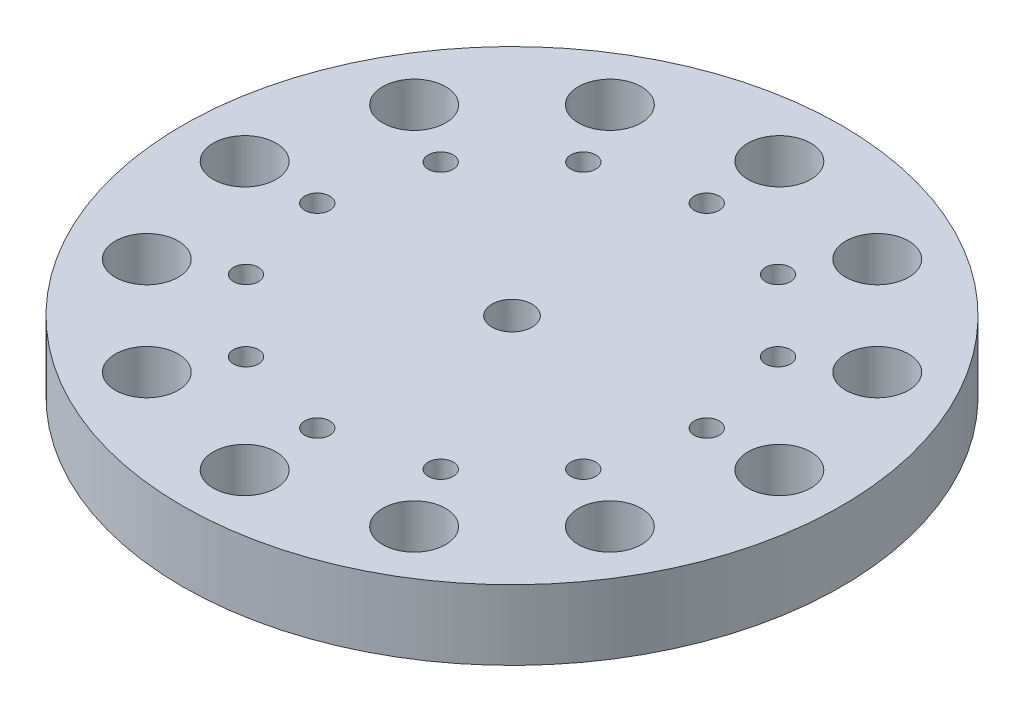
from build123d import *

# Parameters (mm, degrees)
SKETCH2_W                                   = 104.775
SKETCH2_H                                   = 22.225
SKETCH2_3_W                                 = 104.775
SKETCH2_3_H                                 = 38.1
SKETCH18_R                                  = 87
CUT_EXTRUDE2_DEPTH                          = 19.05
CBORE_FOR_M12_SHCS1_AT_2_COUNT              = 2
CBORE_FOR_M12_SHCS1_AT_2_PITCH              = 43.999235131
CBORE_FOR_M12_SHCS1_AT_3_COUNT              = 2
CBORE_FOR_M12_SHCS1_AT_3_PITCH              = 84.9999951
CBORE_FOR_M12_SHCS1_AT_4_COUNT              = 2
CBORE_FOR_M12_SHCS1_AT_4_PITCH              = 120.208145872
CBORE_FOR_M12_SHCS1_AT_5_COUNT              = 2
CBORE_FOR_M12_SHCS1_AT_5_PITCH              = 147.224310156
CBORE_FOR_M12_SHCS1_AT_6_COUNT              = 2
CBORE_FOR_M12_SHCS1_AT_6_PITCH              = 164.207381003
CBORE_FOR_M12_SHCS1_AT_7_COUNT              = 2
CBORE_FOR_M12_SHCS1_AT_7_PITCH              = 169.9999902
CBORE_FOR_M12_SHCS1_AT_8_COUNT              = 2
CBORE_FOR_M12_SHCS1_AT_8_PITCH              = 164.207381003
CBORE_FOR_M12_SHCS1_AT_9_COUNT              = 2
CBORE_FOR_M12_SHCS1_AT_9_PITCH              = 147.224310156
CBORE_FOR_M12_SHCS1_AT_10_COUNT             = 2
CBORE_FOR_M12_SHCS1_AT_10_PITCH             = 120.208145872
CBORE_FOR_M12_SHCS1_AT_11_COUNT             = 2
CBORE_FOR_M12_SHCS1_AT_11_PITCH             = 84.9999951
CBORE_FOR_M12_SHCS1_AT_12_COUNT             = 2
CBORE_FOR_M12_SHCS1_AT_12_PITCH             = 43.999235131
CBORE_FOR_M6_SHCS1_AT_2_COUNT               = 2
CBORE_FOR_M6_SHCS1_AT_2_PITCH               = 50.469713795
CBORE_FOR_M6_SHCS1_AT_3_COUNT               = 2
CBORE_FOR_M6_SHCS1_AT_3_PITCH               = 97.5
CBORE_FOR_M6_SHCS1_AT_4_COUNT               = 2
CBORE_FOR_M6_SHCS1_AT_4_PITCH               = 137.885822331
CBORE_FOR_M6_SHCS1_AT_5_COUNT               = 2
CBORE_FOR_M6_SHCS1_AT_5_PITCH               = 168.874953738
CBORE_FOR_M6_SHCS1_AT_6_COUNT               = 2
CBORE_FOR_M6_SHCS1_AT_6_PITCH               = 188.355536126
CBORE_FOR_M6_SHCS1_AT_7_COUNT               = 2
CBORE_FOR_M6_SHCS1_AT_7_PITCH               = 195
CBORE_FOR_M6_SHCS1_AT_8_COUNT               = 2
CBORE_FOR_M6_SHCS1_AT_8_PITCH               = 188.355536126
CBORE_FOR_M6_SHCS1_AT_9_COUNT               = 2
CBORE_FOR_M6_SHCS1_AT_9_PITCH               = 168.874953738
CBORE_FOR_M6_SHCS1_AT_10_COUNT              = 2
CBORE_FOR_M6_SHCS1_AT_10_PITCH              = 137.885822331
CBORE_FOR_M6_SHCS1_AT_11_COUNT              = 2
CBORE_FOR_M6_SHCS1_AT_11_PITCH              = 97.5
CBORE_FOR_M6_SHCS1_AT_12_COUNT              = 2
CBORE_FOR_M6_SHCS1_AT_12_PITCH              = 50.469713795
CBORE_FOR_3_8_HEX_WASHER_SCREW1_AT_2_COUNT  = 2
CBORE_FOR_3_8_HEX_WASHER_SCREW1_AT_2_PITCH  = 32.04826826
CBORE_FOR_3_8_HEX_WASHER_SCREW1_AT_3_COUNT  = 2
CBORE_FOR_3_8_HEX_WASHER_SCREW1_AT_3_PITCH  = 61.9125
CBORE_FOR_3_8_HEX_WASHER_SCREW1_AT_4_COUNT  = 2
CBORE_FOR_3_8_HEX_WASHER_SCREW1_AT_4_PITCH  = 87.55749718
CBORE_FOR_3_8_HEX_WASHER_SCREW1_AT_5_COUNT  = 2
CBORE_FOR_3_8_HEX_WASHER_SCREW1_AT_5_PITCH  = 107.235595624
CBORE_FOR_3_8_HEX_WASHER_SCREW1_AT_6_COUNT  = 2
CBORE_FOR_3_8_HEX_WASHER_SCREW1_AT_6_PITCH  = 119.60576544
CBORE_FOR_3_8_HEX_WASHER_SCREW1_AT_7_COUNT  = 2
CBORE_FOR_3_8_HEX_WASHER_SCREW1_AT_7_PITCH  = 123.825
CBORE_FOR_3_8_HEX_WASHER_SCREW1_AT_8_COUNT  = 2
CBORE_FOR_3_8_HEX_WASHER_SCREW1_AT_8_PITCH  = 119.60576544
CBORE_FOR_3_8_HEX_WASHER_SCREW1_AT_9_COUNT  = 2
CBORE_FOR_3_8_HEX_WASHER_SCREW1_AT_9_PITCH  = 107.235595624
CBORE_FOR_3_8_HEX_WASHER_SCREW1_AT_10_COUNT = 2
CBORE_FOR_3_8_HEX_WASHER_SCREW1_AT_10_PITCH = 87.55749718
CBORE_FOR_3_8_HEX_WASHER_SCREW1_AT_11_COUNT = 2
CBORE_FOR_3_8_HEX_WASHER_SCREW1_AT_11_PITCH = 61.9125
CBORE_FOR_3_8_HEX_WASHER_SCREW1_AT_12_COUNT = 2
CBORE_FOR_3_8_HEX_WASHER_SCREW1_AT_12_PITCH = 32.04826826
SKETCH14_W                                  = 3.96875
SKETCH14_H                                  = 22.225
F_3_8_16_TAPPED_HOLE1_AT_2_COUNT            = 2
F_3_8_16_TAPPED_HOLE1_AT_2_PITCH            = 32.04826826
F_3_8_16_TAPPED_HOLE1_AT_3_COUNT            = 2
F_3_8_16_TAPPED_HOLE1_AT_3_PITCH            = 61.9125
F_3_8_16_TAPPED_HOLE1_AT_4_COUNT            = 2
F_3_8_16_TAPPED_HOLE1_AT_4_PITCH            = 87.55749718
F_3_8_16_TAPPED_HOLE1_AT_5_COUNT            = 2
F_3_8_16_TAPPED_HOLE1_AT_5_PITCH            = 107.235595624
F_3_8_16_TAPPED_HOLE1_AT_6_COUNT            = 2
F_3_8_16_TAPPED_HOLE1_AT_6_PITCH            = 119.60576544
F_3_8_16_TAPPED_HOLE1_AT_7_COUNT            = 2
F_3_8_16_TAPPED_HOLE1_AT_7_PITCH            = 123.825
F_3_8_16_TAPPED_HOLE1_AT_8_COUNT            = 2
F_3_8_16_TAPPED_HOLE1_AT_8_PITCH            = 119.60576544
F_3_8_16_TAPPED_HOLE1_AT_9_COUNT            = 2
F_3_8_16_TAPPED_HOLE1_AT_9_PITCH            = 107.235595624
F_3_8_16_TAPPED_HOLE1_AT_10_COUNT           = 2
F_3_8_16_TAPPED_HOLE1_AT_10_PITCH           = 87.55749718
F_3_8_16_TAPPED_HOLE1_AT_11_COUNT           = 2
F_3_8_16_TAPPED_HOLE1_AT_11_PITCH           = 61.9125
F_3_8_16_TAPPED_HOLE1_AT_12_COUNT           = 2
F_3_8_16_TAPPED_HOLE1_AT_12_PITCH           = 32.04826826
SKETCH15_R                                  = 92.974600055
SKETCH15_R_2                                = 87
BOSS_EXTRUDE1_DEPTH                         = 3.175
CHAMFER1_SIZE                               = 0.508
SKETCH16_R                                  = 76.4921
SKETCH16_R_2                                = 3.96875
BOSS_EXTRUDE2_DEPTH                         = 9.525
CHAMFER2_SIZE                               = 0.508
CUT_EXTRUDE1_DEPTH                          = 166.191561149
CUT_EXTRUDE1_DEPTH_BACK                     = 166.191561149
SKETCH17_R                                  = 6.3627


with BuildPart() as part:
    # Sketch2 → Revolve2 (revolve)
    with BuildSketch(Plane(origin=(0, 0, 0), x_dir=(0, 0, -1), z_dir=(1, 0, 0))):
        with Locations((-52.3875, 11.1125)):
            Rectangle(SKETCH2_W, SKETCH2_H)
    revolve(axis=Axis((0, 0, 0), (0, -1, 0)))

    # Sketch4 → CBORE for M12 SHCS1 (revolve, cut)
    with BuildSketch(Plane(origin=(0, 22.225, -84.9999951), x_dir=(0, 0, 1), z_dir=(1, 0, 0))):
        Polygon((0, 0), (0, 22.225), (6.5, 22.225), (6.5, 14.999994), (10, 14.999994), (10, 0), align=None)
    cbore_for_m12_shcs1 = revolve(axis=Axis((0, 28.575, -84.9999951), (0, -1, 0)), mode=Mode.SUBTRACT)

    # CBORE for M12 SHCS1 at 2: CBORE for M12 SHCS1 ×2
    with Locations(*[Vector(0.9659258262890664, 0, 0.2588190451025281) * (i * CBORE_FOR_M12_SHCS1_AT_2_PITCH) for i in range(1, CBORE_FOR_M12_SHCS1_AT_2_COUNT)]):
        add(cbore_for_m12_shcs1, mode=Mode.SUBTRACT)

    # CBORE for M12 SHCS1 at 3: CBORE for M12 SHCS1 ×2
    with Locations(*[Vector(0.8660254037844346, 0, 0.5000000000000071) * (i * CBORE_FOR_M12_SHCS1_AT_3_PITCH) for i in range(1, CBORE_FOR_M12_SHCS1_AT_3_COUNT)]):
        add(cbore_for_m12_shcs1, mode=Mode.SUBTRACT)

    # CBORE for M12 SHCS1 at 4: CBORE for M12 SHCS1 ×2
    with Locations(*[Vector(0.7071067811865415, 0, 0.7071067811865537) * (i * CBORE_FOR_M12_SHCS1_AT_4_PITCH) for i in range(1, CBORE_FOR_M12_SHCS1_AT_4_COUNT)]):
        add(cbore_for_m12_shcs1, mode=Mode.SUBTRACT)

    # CBORE for M12 SHCS1 at 5: CBORE for M12 SHCS1 ×2
    with Locations(*[Vector(0.499999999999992, 0, 0.8660254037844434) * (i * CBORE_FOR_M12_SHCS1_AT_5_PITCH) for i in range(1, CBORE_FOR_M12_SHCS1_AT_5_COUNT)]):
        add(cbore_for_m12_shcs1, mode=Mode.SUBTRACT)

    # CBORE for M12 SHCS1 at 6: CBORE for M12 SHCS1 ×2
    with Locations(*[Vector(0.25881904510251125, 0, 0.9659258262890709) * (i * CBORE_FOR_M12_SHCS1_AT_6_PITCH) for i in range(1, CBORE_FOR_M12_SHCS1_AT_6_COUNT)]):
        add(cbore_for_m12_shcs1, mode=Mode.SUBTRACT)

    # CBORE for M12 SHCS1 at 7: CBORE for M12 SHCS1 ×2
    with Locations(*[(0, 0, i * CBORE_FOR_M12_SHCS1_AT_7_PITCH) for i in range(1, CBORE_FOR_M12_SHCS1_AT_7_COUNT)]):
        add(cbore_for_m12_shcs1, mode=Mode.SUBTRACT)

    # CBORE for M12 SHCS1 at 8: CBORE for M12 SHCS1 ×2
    with Locations(*[Vector(-0.2588190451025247, 0, 0.9659258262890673) * (i * CBORE_FOR_M12_SHCS1_AT_8_PITCH) for i in range(1, CBORE_FOR_M12_SHCS1_AT_8_COUNT)]):
        add(cbore_for_m12_shcs1, mode=Mode.SUBTRACT)

    # CBORE for M12 SHCS1 at 9: CBORE for M12 SHCS1 ×2
    with Locations(*[Vector(-0.5000000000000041, 0, 0.8660254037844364) * (i * CBORE_FOR_M12_SHCS1_AT_9_PITCH) for i in range(1, CBORE_FOR_M12_SHCS1_AT_9_COUNT)]):
        add(cbore_for_m12_shcs1, mode=Mode.SUBTRACT)

    # CBORE for M12 SHCS1 at 10: CBORE for M12 SHCS1 ×2
    with Locations(*[Vector(-0.7071067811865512, 0, 0.7071067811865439) * (i * CBORE_FOR_M12_SHCS1_AT_10_PITCH) for i in range(1, CBORE_FOR_M12_SHCS1_AT_10_COUNT)]):
        add(cbore_for_m12_shcs1, mode=Mode.SUBTRACT)

    # CBORE for M12 SHCS1 at 11: CBORE for M12 SHCS1 ×2
    with Locations(*[Vector(-0.8660254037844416, 0, 0.4999999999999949) * (i * CBORE_FOR_M12_SHCS1_AT_11_PITCH) for i in range(1, CBORE_FOR_M12_SHCS1_AT_11_COUNT)]):
        add(cbore_for_m12_shcs1, mode=Mode.SUBTRACT)

    # CBORE for M12 SHCS1 at 12: CBORE for M12 SHCS1 ×2
    with Locations(*[Vector(-0.96592582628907, 0, 0.2588190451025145) * (i * CBORE_FOR_M12_SHCS1_AT_12_PITCH) for i in range(1, CBORE_FOR_M12_SHCS1_AT_12_COUNT)]):
        add(cbore_for_m12_shcs1, mode=Mode.SUBTRACT)

    # Sketch14 → 3_8-16 Tapped Hole1 (revolve, cut)
    with BuildSketch(Plane(origin=(-53.617797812, 22.225, -30.95625), x_dir=(0, 0, 1), z_dir=(1, 0, 0))):
        with Locations((1.984375, 11.1125)):
            Rectangle(SKETCH14_W, SKETCH14_H)
    f_3_8_16_tapped_hole1 = revolve(axis=Axis((-53.617797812, 28.575, -30.95625), (0, -1, 0)), mode=Mode.SUBTRACT)

    # 3_8-16 Tapped Hole1 at 2: 3_8-16 Tapped Hole1 ×2
    with Locations(*[Vector(-0.25881904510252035, 0, 0.9659258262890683) * (i * F_3_8_16_TAPPED_HOLE1_AT_2_PITCH) for i in range(1, F_3_8_16_TAPPED_HOLE1_AT_2_COUNT)]):
        add(f_3_8_16_tapped_hole1, mode=Mode.SUBTRACT)

    # 3_8-16 Tapped Hole1 at 3: 3_8-16 Tapped Hole1 ×2
    with Locations(*[(0, 0, i * F_3_8_16_TAPPED_HOLE1_AT_3_PITCH) for i in range(1, F_3_8_16_TAPPED_HOLE1_AT_3_COUNT)]):
        add(f_3_8_16_tapped_hole1, mode=Mode.SUBTRACT)

    # 3_8-16 Tapped Hole1 at 4: 3_8-16 Tapped Hole1 ×2
    with Locations(*[Vector(0.2588190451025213, 0, 0.9659258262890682) * (i * F_3_8_16_TAPPED_HOLE1_AT_4_PITCH) for i in range(1, F_3_8_16_TAPPED_HOLE1_AT_4_COUNT)]):
        add(f_3_8_16_tapped_hole1, mode=Mode.SUBTRACT)

    # 3_8-16 Tapped Hole1 at 5: 3_8-16 Tapped Hole1 ×2
    with Locations(*[Vector(0.5000000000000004, 0, 0.8660254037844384) * (i * F_3_8_16_TAPPED_HOLE1_AT_5_PITCH) for i in range(1, F_3_8_16_TAPPED_HOLE1_AT_5_COUNT)]):
        add(f_3_8_16_tapped_hole1, mode=Mode.SUBTRACT)

    # 3_8-16 Tapped Hole1 at 6: 3_8-16 Tapped Hole1 ×2
    with Locations(*[Vector(0.707106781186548, 0, 0.707106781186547) * (i * F_3_8_16_TAPPED_HOLE1_AT_6_PITCH) for i in range(1, F_3_8_16_TAPPED_HOLE1_AT_6_COUNT)]):
        add(f_3_8_16_tapped_hole1, mode=Mode.SUBTRACT)

    # 3_8-16 Tapped Hole1 at 7: 3_8-16 Tapped Hole1 ×2
    with Locations(*[Vector(0.8660254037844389, 0, 0.49999999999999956) * (i * F_3_8_16_TAPPED_HOLE1_AT_7_PITCH) for i in range(1, F_3_8_16_TAPPED_HOLE1_AT_7_COUNT)]):
        add(f_3_8_16_tapped_hole1, mode=Mode.SUBTRACT)

    # 3_8-16 Tapped Hole1 at 8: 3_8-16 Tapped Hole1 ×2
    with Locations(*[Vector(0.9659258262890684, 0, 0.2588190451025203) * (i * F_3_8_16_TAPPED_HOLE1_AT_8_PITCH) for i in range(1, F_3_8_16_TAPPED_HOLE1_AT_8_COUNT)]):
        add(f_3_8_16_tapped_hole1, mode=Mode.SUBTRACT)

    # 3_8-16 Tapped Hole1 at 9: 3_8-16 Tapped Hole1 ×2
    with Locations(*[(i * F_3_8_16_TAPPED_HOLE1_AT_9_PITCH, 0, 0) for i in range(1, F_3_8_16_TAPPED_HOLE1_AT_9_COUNT)]):
        add(f_3_8_16_tapped_hole1, mode=Mode.SUBTRACT)

    # 3_8-16 Tapped Hole1 at 10: 3_8-16 Tapped Hole1 ×2
    with Locations(*[Vector(0.9659258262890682, 0, -0.2588190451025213) * (i * F_3_8_16_TAPPED_HOLE1_AT_10_PITCH) for i in range(1, F_3_8_16_TAPPED_HOLE1_AT_10_COUNT)]):
        add(f_3_8_16_tapped_hole1, mode=Mode.SUBTRACT)

    # 3_8-16 Tapped Hole1 at 11: 3_8-16 Tapped Hole1 ×2
    with Locations(*[Vector(0.8660254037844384, 0, -0.5000000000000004) * (i * F_3_8_16_TAPPED_HOLE1_AT_11_PITCH) for i in range(1, F_3_8_16_TAPPED_HOLE1_AT_11_COUNT)]):
        add(f_3_8_16_tapped_hole1, mode=Mode.SUBTRACT)

    # 3_8-16 Tapped Hole1 at 12: 3_8-16 Tapped Hole1 ×2
    with Locations(*[Vector(0.707106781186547, 0, -0.7071067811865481) * (i * F_3_8_16_TAPPED_HOLE1_AT_12_PITCH) for i in range(1, F_3_8_16_TAPPED_HOLE1_AT_12_COUNT)]):
        add(f_3_8_16_tapped_hole1, mode=Mode.SUBTRACT)

    # Sketch16 → Boss-Extrude2 (add)
    with BuildSketch(Plane.XZ):
        with Locations(Location((0, 0, 0), (0, 0, 90))):
            Circle(SKETCH16_R)
        with Locations(Location((0, -61.9125, 0), (0, 0, 90))):
            Circle(SKETCH16_R_2, mode=Mode.SUBTRACT)
        with Locations(Location((30.95625, -53.617797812, 0), (0, 0, 90))):
            Circle(SKETCH16_R_2, mode=Mode.SUBTRACT)
        with Locations(Location((53.617797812, -30.95625, 0), (0, 0, 90))):
            Circle(SKETCH16_R_2, mode=Mode.SUBTRACT)
        with Locations(Location((61.9125, 0, 0), (0, 0, 90))):
            Circle(SKETCH16_R_2, mode=Mode.SUBTRACT)
        with Locations(Location((53.617797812, 30.95625, 0), (0, 0, 90))):
            Circle(SKETCH16_R_2, mode=Mode.SUBTRACT)
        with Locations(Location((30.95625, 53.617797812, 0), (0, 0, 90))):
            Circle(SKETCH16_R_2, mode=Mode.SUBTRACT)
        with Locations(Location((0, 61.9125, 0), (0, 0, 90))):
            Circle(SKETCH16_R_2, mode=Mode.SUBTRACT)
        with Locations(Location((-30.95625, 53.617797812, 0), (0, 0, 90))):
            Circle(SKETCH16_R_2, mode=Mode.SUBTRACT)
        with Locations(Location((-53.617797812, 30.95625, 0), (0, 0, 90))):
            Circle(SKETCH16_R_2, mode=Mode.SUBTRACT)
        with Locations(Location((-61.9125, 0, 0), (0, 0, 90))):
            Circle(SKETCH16_R_2, mode=Mode.SUBTRACT)
        with Locations(Location((-53.617797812, -30.95625, 0), (0, 0, 90))):
            Circle(SKETCH16_R_2, mode=Mode.SUBTRACT)
        with Locations(Location((-30.95625, -53.617797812, 0), (0, 0, 90))):
            Circle(SKETCH16_R_2, mode=Mode.SUBTRACT)
    extrude(amount=BOSS_EXTRUDE2_DEPTH)

    # Chamfer2
    chamfer2_edges = [part.edges().sort_by_distance(p)[0] for p in [
        (0, -9.525, -76.4921),
    ]]
    chamfer(chamfer2_edges, length=CHAMFER2_SIZE)


with BuildPart() as body_2:
    # Sketch2_3 → Revolve3 (revolve)
    with BuildSketch(Plane(origin=(0, 0, 0), x_dir=(0, 0, -1), z_dir=(1, 0, 0))):
        with Locations((-52.3875, 41.275)):
            Rectangle(SKETCH2_3_W, SKETCH2_3_H)
    revolve(axis=Axis((0, 0, 0), (0, -1, 0)))

    # Sketch18 → Cut-Extrude2 (cut)
    with BuildSketch(Plane(origin=(0, 60.325, 0), x_dir=(1, 0, 0), z_dir=(0, 1, 0))):
        with Locations(Location((0, 0, 0), (0, 0, 270))):
            Circle(SKETCH18_R)
    extrude(amount=-CUT_EXTRUDE2_DEPTH, mode=Mode.SUBTRACT)

    # Sketch7 → CBORE for M6 SHCS1 (revolve, cut)
    with BuildSketch(Plane(origin=(0, 22.225, -97.5), x_dir=(0, 0, -1), z_dir=(1, 0, 0))):
        Polygon((0, 0), (0, 38.1), (3.2, 38.1), (3.2, 7.999996), (5.5, 7.999996), (5.5, 0), align=None)
    cbore_for_m6_shcs1 = revolve(axis=Axis((0, 15.875, -97.5), (0, 1, 0)), mode=Mode.SUBTRACT)

    # CBORE for M6 SHCS1 at 2: CBORE for M6 SHCS1 ×2
    with Locations(*[Vector(-0.9659258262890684, 0, 0.2588190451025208) * (i * CBORE_FOR_M6_SHCS1_AT_2_PITCH) for i in range(1, CBORE_FOR_M6_SHCS1_AT_2_COUNT)]):
        add(cbore_for_m6_shcs1, mode=Mode.SUBTRACT)

    # CBORE for M6 SHCS1 at 3: CBORE for M6 SHCS1 ×2
    with Locations(*[Vector(-0.8660254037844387, 0, 0.5000000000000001) * (i * CBORE_FOR_M6_SHCS1_AT_3_PITCH) for i in range(1, CBORE_FOR_M6_SHCS1_AT_3_COUNT)]):
        add(cbore_for_m6_shcs1, mode=Mode.SUBTRACT)

    # CBORE for M6 SHCS1 at 4: CBORE for M6 SHCS1 ×2
    with Locations(*[Vector(-0.7071067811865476, 0, 0.7071067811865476) * (i * CBORE_FOR_M6_SHCS1_AT_4_PITCH) for i in range(1, CBORE_FOR_M6_SHCS1_AT_4_COUNT)]):
        add(cbore_for_m6_shcs1, mode=Mode.SUBTRACT)

    # CBORE for M6 SHCS1 at 5: CBORE for M6 SHCS1 ×2
    with Locations(*[Vector(-0.5000000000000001, 0, 0.8660254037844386) * (i * CBORE_FOR_M6_SHCS1_AT_5_PITCH) for i in range(1, CBORE_FOR_M6_SHCS1_AT_5_COUNT)]):
        add(cbore_for_m6_shcs1, mode=Mode.SUBTRACT)

    # CBORE for M6 SHCS1 at 6: CBORE for M6 SHCS1 ×2
    with Locations(*[Vector(-0.25881904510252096, 0, 0.9659258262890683) * (i * CBORE_FOR_M6_SHCS1_AT_6_PITCH) for i in range(1, CBORE_FOR_M6_SHCS1_AT_6_COUNT)]):
        add(cbore_for_m6_shcs1, mode=Mode.SUBTRACT)

    # CBORE for M6 SHCS1 at 7: CBORE for M6 SHCS1 ×2
    with Locations(*[(0, 0, i * CBORE_FOR_M6_SHCS1_AT_7_PITCH) for i in range(1, CBORE_FOR_M6_SHCS1_AT_7_COUNT)]):
        add(cbore_for_m6_shcs1, mode=Mode.SUBTRACT)

    # CBORE for M6 SHCS1 at 8: CBORE for M6 SHCS1 ×2
    with Locations(*[Vector(0.2588190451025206, 0, 0.9659258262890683) * (i * CBORE_FOR_M6_SHCS1_AT_8_PITCH) for i in range(1, CBORE_FOR_M6_SHCS1_AT_8_COUNT)]):
        add(cbore_for_m6_shcs1, mode=Mode.SUBTRACT)

    # CBORE for M6 SHCS1 at 9: CBORE for M6 SHCS1 ×2
    with Locations(*[Vector(0.49999999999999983, 0, 0.8660254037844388) * (i * CBORE_FOR_M6_SHCS1_AT_9_PITCH) for i in range(1, CBORE_FOR_M6_SHCS1_AT_9_COUNT)]):
        add(cbore_for_m6_shcs1, mode=Mode.SUBTRACT)

    # CBORE for M6 SHCS1 at 10: CBORE for M6 SHCS1 ×2
    with Locations(*[Vector(0.7071067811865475, 0, 0.7071067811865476) * (i * CBORE_FOR_M6_SHCS1_AT_10_PITCH) for i in range(1, CBORE_FOR_M6_SHCS1_AT_10_COUNT)]):
        add(cbore_for_m6_shcs1, mode=Mode.SUBTRACT)

    # CBORE for M6 SHCS1 at 11: CBORE for M6 SHCS1 ×2
    with Locations(*[Vector(0.8660254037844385, 0, 0.5000000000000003) * (i * CBORE_FOR_M6_SHCS1_AT_11_PITCH) for i in range(1, CBORE_FOR_M6_SHCS1_AT_11_COUNT)]):
        add(cbore_for_m6_shcs1, mode=Mode.SUBTRACT)

    # CBORE for M6 SHCS1 at 12: CBORE for M6 SHCS1 ×2
    with Locations(*[Vector(0.9659258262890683, 0, 0.2588190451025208) * (i * CBORE_FOR_M6_SHCS1_AT_12_PITCH) for i in range(1, CBORE_FOR_M6_SHCS1_AT_12_COUNT)]):
        add(cbore_for_m6_shcs1, mode=Mode.SUBTRACT)

    # Sketch12 → CBORE for 3_8 Hex Washer Screw1 (revolve, cut)
    with BuildSketch(Plane(origin=(0, 41.275, -61.9125), x_dir=(0, 0, 1), z_dir=(1, 0, 0))):
        Polygon((0, 0), (0, 41.275), (4.9022, 41.275), (4.9022, 10.6934), (11.1125, 10.6934), (11.1125, 0), align=None)
    cbore_for_3_8_hex_washer_screw1 = revolve(axis=Axis((0, 47.625, -61.9125), (0, -1, 0)), mode=Mode.SUBTRACT)

    # CBORE for 3_8 Hex Washer Screw1 at 2: CBORE for 3_8 Hex Washer Screw1 ×2
    with Locations(*[Vector(0.9659258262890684, 0, 0.2588190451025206) * (i * CBORE_FOR_3_8_HEX_WASHER_SCREW1_AT_2_PITCH) for i in range(1, CBORE_FOR_3_8_HEX_WASHER_SCREW1_AT_2_COUNT)]):
        add(cbore_for_3_8_hex_washer_screw1, mode=Mode.SUBTRACT)

    # CBORE for 3_8 Hex Washer Screw1 at 3: CBORE for 3_8 Hex Washer Screw1 ×2
    with Locations(*[Vector(0.8660254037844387, 0, 0.49999999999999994) * (i * CBORE_FOR_3_8_HEX_WASHER_SCREW1_AT_3_PITCH) for i in range(1, CBORE_FOR_3_8_HEX_WASHER_SCREW1_AT_3_COUNT)]):
        add(cbore_for_3_8_hex_washer_screw1, mode=Mode.SUBTRACT)

    # CBORE for 3_8 Hex Washer Screw1 at 4: CBORE for 3_8 Hex Washer Screw1 ×2
    with Locations(*[Vector(0.7071067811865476, 0, 0.7071067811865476) * (i * CBORE_FOR_3_8_HEX_WASHER_SCREW1_AT_4_PITCH) for i in range(1, CBORE_FOR_3_8_HEX_WASHER_SCREW1_AT_4_COUNT)]):
        add(cbore_for_3_8_hex_washer_screw1, mode=Mode.SUBTRACT)

    # CBORE for 3_8 Hex Washer Screw1 at 5: CBORE for 3_8 Hex Washer Screw1 ×2
    with Locations(*[Vector(0.5000000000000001, 0, 0.8660254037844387) * (i * CBORE_FOR_3_8_HEX_WASHER_SCREW1_AT_5_PITCH) for i in range(1, CBORE_FOR_3_8_HEX_WASHER_SCREW1_AT_5_COUNT)]):
        add(cbore_for_3_8_hex_washer_screw1, mode=Mode.SUBTRACT)

    # CBORE for 3_8 Hex Washer Screw1 at 6: CBORE for 3_8 Hex Washer Screw1 ×2
    with Locations(*[Vector(0.25881904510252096, 0, 0.9659258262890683) * (i * CBORE_FOR_3_8_HEX_WASHER_SCREW1_AT_6_PITCH) for i in range(1, CBORE_FOR_3_8_HEX_WASHER_SCREW1_AT_6_COUNT)]):
        add(cbore_for_3_8_hex_washer_screw1, mode=Mode.SUBTRACT)

    # CBORE for 3_8 Hex Washer Screw1 at 7: CBORE for 3_8 Hex Washer Screw1 ×2
    with Locations(*[(0, 0, i * CBORE_FOR_3_8_HEX_WASHER_SCREW1_AT_7_PITCH) for i in range(1, CBORE_FOR_3_8_HEX_WASHER_SCREW1_AT_7_COUNT)]):
        add(cbore_for_3_8_hex_washer_screw1, mode=Mode.SUBTRACT)

    # CBORE for 3_8 Hex Washer Screw1 at 8: CBORE for 3_8 Hex Washer Screw1 ×2
    with Locations(*[Vector(-0.25881904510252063, 0, 0.9659258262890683) * (i * CBORE_FOR_3_8_HEX_WASHER_SCREW1_AT_8_PITCH) for i in range(1, CBORE_FOR_3_8_HEX_WASHER_SCREW1_AT_8_COUNT)]):
        add(cbore_for_3_8_hex_washer_screw1, mode=Mode.SUBTRACT)

    # CBORE for 3_8 Hex Washer Screw1 at 9: CBORE for 3_8 Hex Washer Screw1 ×2
    with Locations(*[Vector(-0.49999999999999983, 0, 0.8660254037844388) * (i * CBORE_FOR_3_8_HEX_WASHER_SCREW1_AT_9_PITCH) for i in range(1, CBORE_FOR_3_8_HEX_WASHER_SCREW1_AT_9_COUNT)]):
        add(cbore_for_3_8_hex_washer_screw1, mode=Mode.SUBTRACT)

    # CBORE for 3_8 Hex Washer Screw1 at 10: CBORE for 3_8 Hex Washer Screw1 ×2
    with Locations(*[Vector(-0.7071067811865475, 0, 0.7071067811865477) * (i * CBORE_FOR_3_8_HEX_WASHER_SCREW1_AT_10_PITCH) for i in range(1, CBORE_FOR_3_8_HEX_WASHER_SCREW1_AT_10_COUNT)]):
        add(cbore_for_3_8_hex_washer_screw1, mode=Mode.SUBTRACT)

    # CBORE for 3_8 Hex Washer Screw1 at 11: CBORE for 3_8 Hex Washer Screw1 ×2
    with Locations(*[Vector(-0.8660254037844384, 0, 0.5000000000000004) * (i * CBORE_FOR_3_8_HEX_WASHER_SCREW1_AT_11_PITCH) for i in range(1, CBORE_FOR_3_8_HEX_WASHER_SCREW1_AT_11_COUNT)]):
        add(cbore_for_3_8_hex_washer_screw1, mode=Mode.SUBTRACT)

    # CBORE for 3_8 Hex Washer Screw1 at 12: CBORE for 3_8 Hex Washer Screw1 ×2
    with Locations(*[Vector(-0.9659258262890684, 0, 0.2588190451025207) * (i * CBORE_FOR_3_8_HEX_WASHER_SCREW1_AT_12_PITCH) for i in range(1, CBORE_FOR_3_8_HEX_WASHER_SCREW1_AT_12_COUNT)]):
        add(cbore_for_3_8_hex_washer_screw1, mode=Mode.SUBTRACT)

    # Sketch15 → Boss-Extrude1 (add)
    with BuildSketch(Plane(origin=(0, 60.325, 0), x_dir=(1, 0, 0), z_dir=(0, 1, 0))):
        with Locations(Location((0, 0, 0), (0, 0, 270))):
            Circle(SKETCH15_R)
        with Locations(Location((0, 0, 0), (0, 0, 270))):
            Circle(SKETCH15_R_2, mode=Mode.SUBTRACT)
    extrude(amount=BOSS_EXTRUDE1_DEPTH)

    # Chamfer1
    chamfer1_edges = [body_2.edges().sort_by_distance(p)[0] for p in [
        (0, 63.5, -92.974600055),
    ]]
    chamfer(chamfer1_edges, length=CHAMFER1_SIZE)


with BuildPart() as cut_extrude1_tool:
    # Sketch17 → Cut-Extrude1 (new, two sides: drawn at the far end of the back side and taken through both)
    with BuildSketch(Plane(origin=(0, 63.5, 0), x_dir=(1, 0, 0), z_dir=(0, 1, 0)).offset(-CUT_EXTRUDE1_DEPTH_BACK)):
        with Locations(Location((0, 0, 0), (0, 0, 270))):
            Circle(SKETCH17_R)
    extrude(amount=CUT_EXTRUDE1_DEPTH + CUT_EXTRUDE1_DEPTH_BACK)


with BuildPart() as part_1:
    add(part.part)

    # Cut-Extrude1: cut by cut_extrude1_tool
    add(cut_extrude1_tool.part, mode=Mode.SUBTRACT)


with BuildPart() as body_2_1:
    add(body_2.part)

    # Cut-Extrude1: cut by cut_extrude1_tool
    add(cut_extrude1_tool.part, mode=Mode.SUBTRACT)


solid = part_1.part
